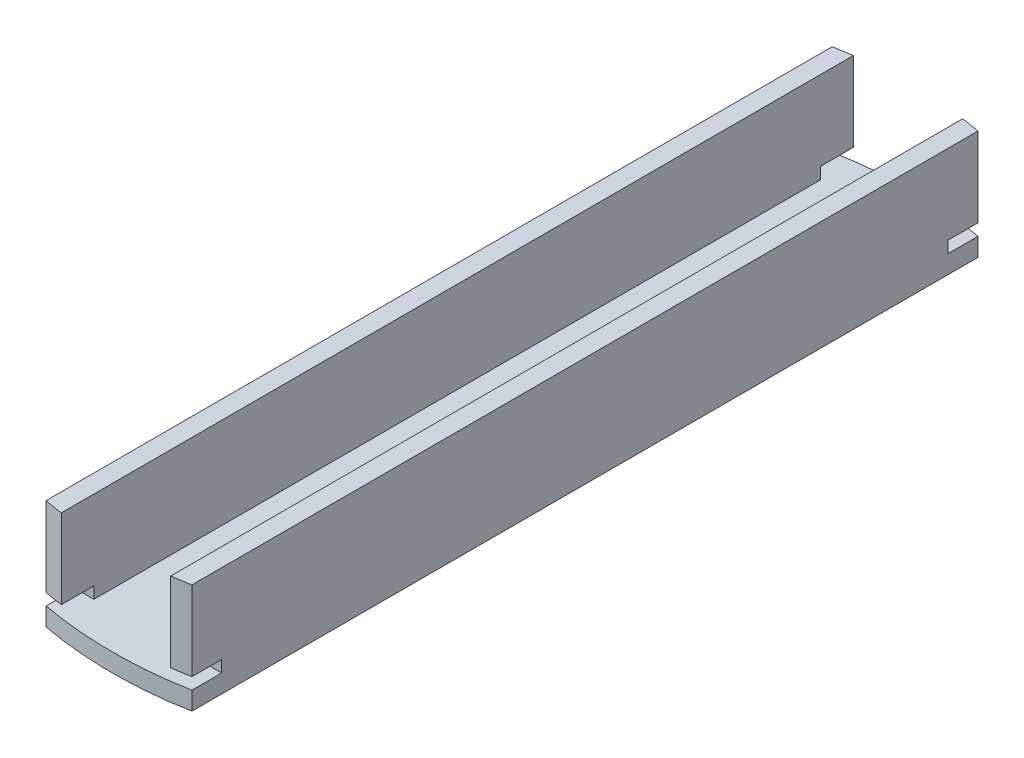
from build123d import *

# Parameters (mm, degrees)
SKETCH1_W          = 25.4
SKETCH1_H          = 19.05
BASE_EXTRUDE_DEPTH = 139.192
SKETCH2_W          = 19.05
SKETCH2_H          = 15.875
CUT_EXTRUDE1_DEPTH = 143.767206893
SKETCH3_R          = 3.2639
CUT_EXTRUDE2_DEPTH = 139.192
SKETCH4_OUTSIDE_W  = 55.954
SKETCH4_OUTSIDE_H  = 169.746
CUT_EXTRUDE6_DEPTH = 143.767206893
SKETCH7_W          = 6.35
SKETCH7_H          = 2.032
CUT_EXTRUDE7_DEPTH = 143.767206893


with BuildPart() as part:
    # Sketch1 → Base-Extrude (new body)
    with BuildSketch(Plane.XY):
        with Locations((12.7, 9.525)):
            Rectangle(SKETCH1_W, SKETCH1_H)
    extrude(amount=BASE_EXTRUDE_DEPTH)

    # Sketch2 → Cut-Extrude1 (cut, through all)
    with BuildSketch(Plane.XY.offset(139.192)):
        with Locations((12.7, 11.1125)):
            Rectangle(SKETCH2_W, SKETCH2_H)
    extrude(amount=-CUT_EXTRUDE1_DEPTH, mode=Mode.SUBTRACT)

    # Sketch3 → Cut-Extrude2 (cut)
    with BuildSketch(Plane.XZ):
        with Locations(Location((12.7, 69.596, 0), (0, 0, 270))):
            Circle(SKETCH3_R)
    extrude(amount=-CUT_EXTRUDE2_DEPTH, mode=Mode.SUBTRACT)

    # Sketch4 outside → Cut-Extrude6 (cut, through all)
    with BuildSketch(Plane.XZ):
        with Locations((12.7, 69.596)):
            Rectangle(SKETCH4_OUTSIDE_W, SKETCH4_OUTSIDE_H)
        with BuildLine():
            Line((25.4, 138.023430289), (25.4, 1.168569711))
            ThreePointArc((25.4, 1.168569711), (12.7, 0), (0, 1.168569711))
            Line((0, 1.168569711), (0, 138.023430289))
            ThreePointArc((0, 138.023430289), (12.7, 139.192), (25.4, 138.023430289))
        make_face(mode=Mode.SUBTRACT)
    extrude(amount=-CUT_EXTRUDE6_DEPTH, mode=Mode.SUBTRACT)

    # Sketch7 → Cut-Extrude7 (cut, through all)
    with BuildSketch(Plane(origin=(25.4, 0, 0), x_dir=(0, 0, -1), z_dir=(1, 0, 0))):
        with Locations((-136.017, 4.191)):
            Rectangle(SKETCH7_W, SKETCH7_H)
        with Locations((-3.175, 4.191)):
            Rectangle(SKETCH7_W, SKETCH7_H)
    extrude(amount=-CUT_EXTRUDE7_DEPTH, mode=Mode.SUBTRACT)


solid = part.part
